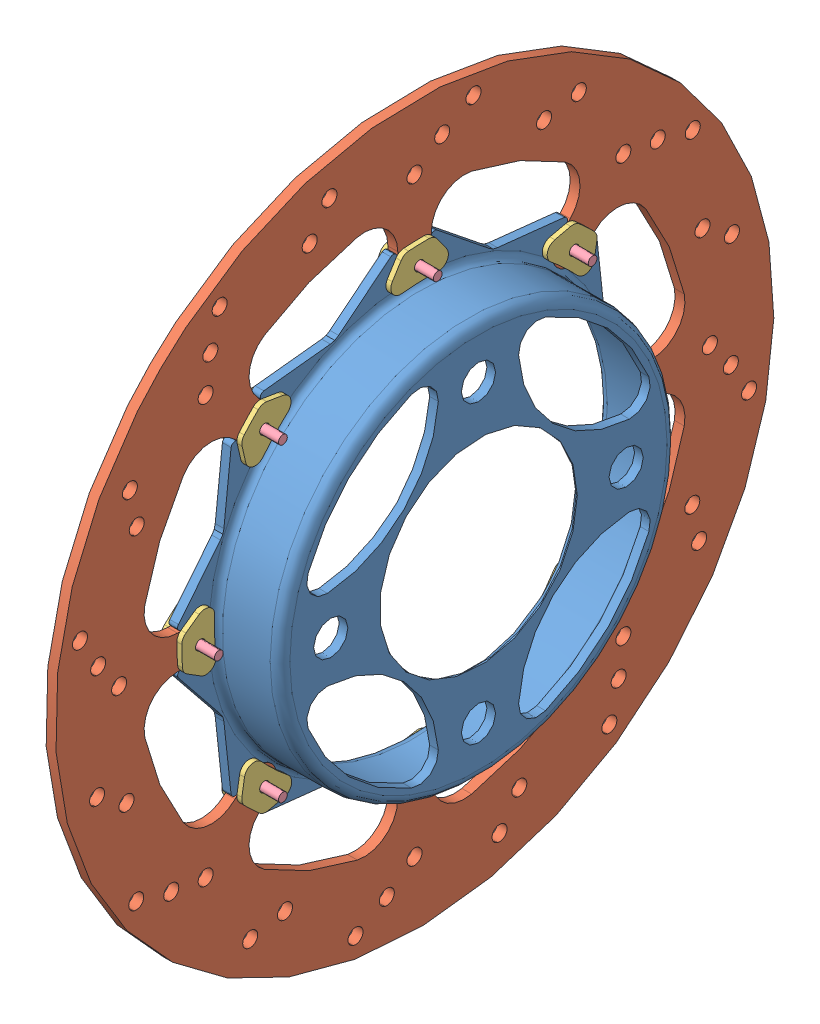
SolidWorks assembly Brake Rotor Assembly.SLDASM, configuration Default (file format 5000). Lengths in mm.
Overall size (25.91 327.78 327.78).
26 component instances, 4 part files, 10 mates.
Components (placement in the parent):
- Rotor Hat-1: Rotor Hat.SLDPRT [Default] at (-34.2242 30.4071 -2.5985) size (23.6 152.4 152.4)
- Rotor - Cast Iron-1: Rotor - Cast Iron.SLDPRT [Default] at (-31.2397 30.4071 -2.5985) x (0 0.707107 0.707107) z (-1 0 0) size (231.78 231.78 3.17)
- Rotor Washer-1: Rotor Washer.SLDPRT [Default] at (-31.2397 33.0101 -12.653) x (0 0.99948 0.032253) z (1 0 0) size (18.57 10.78 1.59)
- Rotor Washer-27: Rotor Washer.SLDPRT [Chamfer] at (-34.4147 41.3596 -11.9484) x (0 -0.990749 -0.135705) z (-1 0 0) size (18.57 10.78 1.59)
- Rotor Pin-6: Rotor Pin.SLDPRT [.5] at (-34.9647 30.4071 68.0135) x (0 0.996402 -0.084747) z (-1 0 0) size (6.36 6.36 12.79)
- Rotor Washer-13: Rotor Washer.SLDPRT [Default] at (-31.2397 25.1381 -11.5488) x (0 0.729545 -0.683933) z (1 0 0) size (18.57 10.78 1.59)
- Rotor Washer-14: Rotor Washer.SLDPRT [Default] at (-31.2397 20.3526 -5.2016) x (0 0.032253 -0.99948) z (1 0 0) size (18.57 10.78 1.59)
- Rotor Washer-15: Rotor Washer.SLDPRT [Default] at (-31.2397 21.4568 2.6705) x (0 -0.683933 -0.729545) z (1 0 0) size (18.57 10.78 1.59)
- Rotor Washer-16: Rotor Washer.SLDPRT [Default] at (-31.2397 27.804 7.456) x (0 -0.99948 -0.032253) z (1 0 0) size (18.57 10.78 1.59)
- Rotor Washer-17: Rotor Washer.SLDPRT [Default] at (-31.2397 35.676 6.3518) x (0 -0.729545 0.683933) z (1 0 0) size (18.57 10.78 1.59)
- Rotor Pin-7: Rotor Pin.SLDPRT [.5] at (-34.9647 80.3373 47.3317) x (0 0.644638 -0.764488) z (-1 0 0) size (6.36 6.36 12.79)
- Rotor Pin-8: Rotor Pin.SLDPRT [.5] at (-34.9647 101.0191 -2.5985) x (0 -0.084747 -0.996402) z (-1 0 0) size (6.36 6.36 12.79)
- Rotor Pin-9: Rotor Pin.SLDPRT [.5] at (-34.9647 80.3373 -52.5287) x (0 -0.764488 -0.644638) z (-1 0 0) size (6.36 6.36 12.79)
- Rotor Pin-10: Rotor Pin.SLDPRT [.5] at (-34.9647 30.4071 -73.2105) x (0 -0.996402 0.084747) z (-1 0 0) size (6.36 6.36 12.79)
- Rotor Pin-11: Rotor Pin.SLDPRT [.5] at (-34.9647 -19.5231 -52.5287) x (0 -0.644638 0.764488) z (-1 0 0) size (6.36 6.36 12.79)
- Rotor Pin-12: Rotor Pin.SLDPRT [.5] at (-34.9647 -40.2049 -2.5985) x (0 0.084747 0.996402) z (-1 0 0) size (6.36 6.36 12.79)
- Rotor Pin-13: Rotor Pin.SLDPRT [.5] at (-34.9647 -19.5231 47.3317) x (0 0.764488 0.644638) z (-1 0 0) size (6.36 6.36 12.79)
- Rotor Washer-25: Rotor Washer.SLDPRT [Default] at (-31.2397 40.4616 0.0046) x (0 -0.032253 0.99948) z (1 0 0) size (18.57 10.78 1.59)
- Rotor Washer-26: Rotor Washer.SLDPRT [Default] at (-31.2397 39.3573 -7.8675) x (0 0.683933 0.729545) z (1 0 0) size (18.57 10.78 1.59)
- Rotor Washer-28: Rotor Washer.SLDPRT [Chamfer] at (-34.4147 31.5403 -16.9545) x (0 -0.796524 0.604608) z (-1 0 0) size (18.57 10.78 1.59)
- Rotor Washer-29: Rotor Washer.SLDPRT [Chamfer] at (-34.4147 21.0572 -13.551) x (0 -0.135705 0.990749) z (-1 0 0) size (18.57 10.78 1.59)
- Rotor Washer-30: Rotor Washer.SLDPRT [Chamfer] at (-34.4147 16.0511 -3.7317) x (0 0.604608 0.796524) z (-1 0 0) size (18.57 10.78 1.59)
- Rotor Washer-31: Rotor Washer.SLDPRT [Chamfer] at (-34.4147 19.4545 6.7514) x (0 0.990749 0.135705) z (-1 0 0) size (18.57 10.78 1.59)
- Rotor Washer-32: Rotor Washer.SLDPRT [Chamfer] at (-34.4147 29.2738 11.7575) x (0 0.796524 -0.604608) z (-1 0 0) size (18.57 10.78 1.59)
- Rotor Washer-33: Rotor Washer.SLDPRT [Chamfer] at (-34.4147 39.757 8.3541) x (0 0.135705 -0.990749) z (-1 0 0) size (18.57 10.78 1.59)
- Rotor Washer-34: Rotor Washer.SLDPRT [Chamfer] at (-34.4147 44.7631 -1.4652) x (0 -0.604608 -0.796524) z (-1 0 0) size (18.57 10.78 1.59)
Mates (geometry in assembly coordinates):
- Coincident1: coincident anti-aligned: plane of Rotor - Cast Iron-1 through (-31.2387 -46.001 2.799) normal (0 0 1); plane of Rotor Hat-1 through (-10.6199 -44.5229 2.799) normal (0 0 -1)
- Distance1: distance = 0.1905 mm aligned: plane of Rotor Hat-1 through (-34.2242 95.5581 -2.5985) normal (-1 0 0); plane of Rotor - Cast Iron-1 through (-34.4147 -149.9716 177.7802) normal (-1 0 0)
- Distance2: distance = 0.1905 mm aligned: plane of Rotor Hat-1 through (-34.2242 95.5581 -2.5985) normal (-1 0 0); plane of Rotor - Cast Iron-1 through (-34.4147 30.4071 -2.5985) normal (-1 0 0)
- Coincident3: coincident anti-aligned: plane of Rotor - Cast Iron-1 through (-31.2397 30.4071 -2.5985) normal (1 0 0); plane of Rotor Washer-1 through (-31.2397 33.4923 70.8481) normal (-1 0 0)
- Concentric4: concentric aligned: cylinder of Rotor Washer-1 through (-29.6522 30.4071 68.0135) axis (-1 0 0) radius 1.5875; cylinder of Rotor - Cast Iron-1 through (-31.2387 30.4071 68.0135) axis (-1 0 0) radius 1.5875
- Coincident5: coincident anti-aligned: plane of Rotor - Cast Iron-1 through (-34.4147 30.4071 -2.5985) normal (-1 0 0); plane of Rotor Washer-27 through (-34.4147 26.8905 70.291) normal (1 0 0)
- Concentric9: concentric anti-aligned: cylinder of Rotor Pin-6 through (-34.9647 30.4071 68.0135) axis (1 0 0) radius 1.4224; cylinder of Rotor - Cast Iron-1 through (-31.2387 30.4071 68.0135) axis (-1 0 0) radius 1.5875
- Coincident6: coincident aligned: cone of Rotor Washer-27 through (-34.5412 30.4071 68.0135) axis (1 0 0); cone of Rotor Pin-6 through (-36.4405 30.4071 68.0135) axis (1 0 0)
- Concentric12: concentric aligned: cylinder of Rotor - Cast Iron-1 through (-34.4147 30.4071 -2.5985) axis (1 0 0) radius 115.8875; circle of Rotor Hat-1
- Concentric13: concentric aligned: cylinder of Rotor - Cast Iron-1 through (-34.4147 30.4071 -2.5985) axis (1 0 0) radius 115.8875; cylinder of Rotor Hat-1 through (-9.4397 30.4071 -2.5985) axis (1 0 0) radius 64.008
